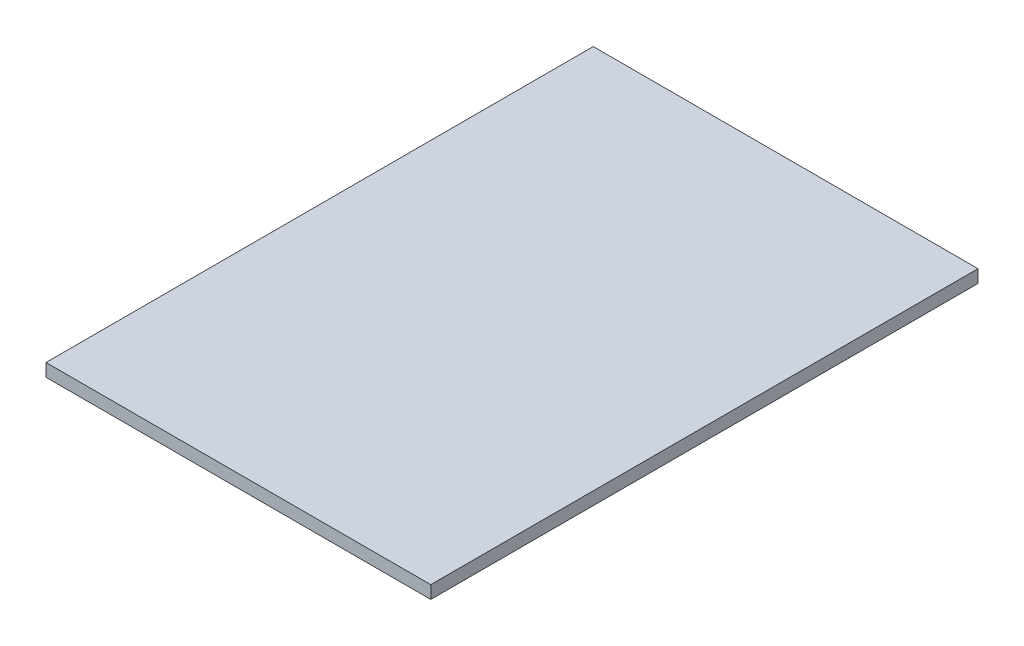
ISO-10303-21;
HEADER;
FILE_DESCRIPTION(('STEP AP214'),'2;1');
FILE_NAME('part.step','',(''),(''),'','','');
FILE_SCHEMA(('AUTOMOTIVE_DESIGN { 1 0 10303 214 1 1 1 1 }'));
ENDSEC;
DATA;
#1=APPLICATION_CONTEXT('core data for automotive mechanical design processes');
#2=APPLICATION_PROTOCOL_DEFINITION('international standard','automotive_design',2000,#1);
#3=PRODUCT_CONTEXT('',#1,'mechanical');
#4=PRODUCT('Part','Part','',(#3));
#5=PRODUCT_RELATED_PRODUCT_CATEGORY('part','',(#4));
#6=PRODUCT_DEFINITION_FORMATION('','',#4);
#7=PRODUCT_DEFINITION_CONTEXT('part definition',#1,'design');
#8=PRODUCT_DEFINITION('design','',#6,#7);
#9=PRODUCT_DEFINITION_SHAPE('','',#8);
#10=(LENGTH_UNIT() NAMED_UNIT(*) SI_UNIT(.MILLI.,.METRE.));
#11=(NAMED_UNIT(*) PLANE_ANGLE_UNIT() SI_UNIT($,.RADIAN.));
#12=(NAMED_UNIT(*) SI_UNIT($,.STERADIAN.) SOLID_ANGLE_UNIT());
#13=UNCERTAINTY_MEASURE_WITH_UNIT(LENGTH_MEASURE(1.E-05),#10,'distance_accuracy_value','');
#14=(GEOMETRIC_REPRESENTATION_CONTEXT(3) GLOBAL_UNCERTAINTY_ASSIGNED_CONTEXT((#13)) GLOBAL_UNIT_ASSIGNED_CONTEXT((#10,
#11,#12)) REPRESENTATION_CONTEXT('',''));
#15=CARTESIAN_POINT('',(0.,0.,0.));
#16=DIRECTION('',(0.,0.,1.));
#17=DIRECTION('',(1.,0.,0.));
#18=AXIS2_PLACEMENT_3D('',#15,#16,#17);
#19=CARTESIAN_POINT('',(0.,4.7625,0.));
#20=DIRECTION('',(1.,0.,0.));
#21=DIRECTION('',(0.,0.,-1.));
#22=AXIS2_PLACEMENT_3D('',#19,#20,#21);
#23=PLANE('',#22);
#24=DIRECTION('',(0.,0.,1.));
#25=VECTOR('',#24,1.);
#26=CARTESIAN_POINT('',(0.,0.,0.));
#27=LINE('',#26,#25);
#28=CARTESIAN_POINT('',(0.,0.,-203.2));
#29=VERTEX_POINT('',#28);
#30=CARTESIAN_POINT('',(0.,0.,0.));
#31=VERTEX_POINT('',#30);
#32=EDGE_CURVE('E98',#29,#31,#27,.T.);
#33=ORIENTED_EDGE('',*,*,#32,.T.);
#34=DIRECTION('',(0.,-1.,0.));
#35=VECTOR('',#34,1.);
#36=CARTESIAN_POINT('',(0.,4.7625,0.));
#37=LINE('',#36,#35);
#38=CARTESIAN_POINT('',(0.,4.7625,0.));
#39=VERTEX_POINT('',#38);
#40=EDGE_CURVE('E11',#39,#31,#37,.T.);
#41=ORIENTED_EDGE('',*,*,#40,.F.);
#42=DIRECTION('',(0.,0.,1.));
#43=VECTOR('',#42,1.);
#44=CARTESIAN_POINT('',(0.,4.7625,0.));
#45=LINE('',#44,#43);
#46=CARTESIAN_POINT('',(0.,4.7625,-203.2));
#47=VERTEX_POINT('',#46);
#48=EDGE_CURVE('E86',#47,#39,#45,.T.);
#49=ORIENTED_EDGE('',*,*,#48,.F.);
#50=DIRECTION('',(0.,-1.,0.));
#51=VECTOR('',#50,1.);
#52=CARTESIAN_POINT('',(0.,4.7625,-203.2));
#53=LINE('',#52,#51);
#54=EDGE_CURVE('E94',#47,#29,#53,.T.);
#55=ORIENTED_EDGE('',*,*,#54,.T.);
#56=EDGE_LOOP('',(#33,#41,#49,#55));
#57=FACE_BOUND('',#56,.T.);
#58=ADVANCED_FACE('F35',(#57),#23,.F.);
#59=CARTESIAN_POINT('',(0.,4.7625,0.));
#60=DIRECTION('',(0.,0.,-1.));
#61=DIRECTION('',(-1.,0.,0.));
#62=AXIS2_PLACEMENT_3D('',#59,#60,#61);
#63=PLANE('',#62);
#64=DIRECTION('',(1.,0.,0.));
#65=VECTOR('',#64,1.);
#66=CARTESIAN_POINT('',(0.,0.,0.));
#67=LINE('',#66,#65);
#68=CARTESIAN_POINT('',(142.875,0.,0.));
#69=VERTEX_POINT('',#68);
#70=EDGE_CURVE('E90',#31,#69,#67,.T.);
#71=ORIENTED_EDGE('',*,*,#70,.T.);
#72=DIRECTION('',(0.,-1.,0.));
#73=VECTOR('',#72,1.);
#74=CARTESIAN_POINT('',(142.875,4.7625,0.));
#75=LINE('',#74,#73);
#76=CARTESIAN_POINT('',(142.875,4.7625,0.));
#77=VERTEX_POINT('',#76);
#78=EDGE_CURVE('E43',#77,#69,#75,.T.);
#79=ORIENTED_EDGE('',*,*,#78,.F.);
#80=DIRECTION('',(1.,0.,0.));
#81=VECTOR('',#80,1.);
#82=CARTESIAN_POINT('',(0.,4.7625,0.));
#83=LINE('',#82,#81);
#84=EDGE_CURVE('E81',#39,#77,#83,.T.);
#85=ORIENTED_EDGE('',*,*,#84,.F.);
#86=ORIENTED_EDGE('',*,*,#40,.T.);
#87=EDGE_LOOP('',(#71,#79,#85,#86));
#88=FACE_BOUND('',#87,.T.);
#89=ADVANCED_FACE('F89',(#88),#63,.F.);
#90=CARTESIAN_POINT('',(142.875,4.7625,0.));
#91=DIRECTION('',(-1.,0.,0.));
#92=DIRECTION('',(0.,0.,1.));
#93=AXIS2_PLACEMENT_3D('',#90,#91,#92);
#94=PLANE('',#93);
#95=DIRECTION('',(0.,0.,-1.));
#96=VECTOR('',#95,1.);
#97=CARTESIAN_POINT('',(142.875,0.,0.));
#98=LINE('',#97,#96);
#99=CARTESIAN_POINT('',(142.875,0.,-203.2));
#100=VERTEX_POINT('',#99);
#101=EDGE_CURVE('E68',#69,#100,#98,.T.);
#102=ORIENTED_EDGE('',*,*,#101,.T.);
#103=DIRECTION('',(0.,-1.,0.));
#104=VECTOR('',#103,1.);
#105=CARTESIAN_POINT('',(142.875,4.7625,-203.2));
#106=LINE('',#105,#104);
#107=CARTESIAN_POINT('',(142.875,4.7625,-203.2));
#108=VERTEX_POINT('',#107);
#109=EDGE_CURVE('E91',#108,#100,#106,.T.);
#110=ORIENTED_EDGE('',*,*,#109,.F.);
#111=DIRECTION('',(0.,0.,-1.));
#112=VECTOR('',#111,1.);
#113=CARTESIAN_POINT('',(142.875,4.7625,0.));
#114=LINE('',#113,#112);
#115=EDGE_CURVE('E84',#77,#108,#114,.T.);
#116=ORIENTED_EDGE('',*,*,#115,.F.);
#117=ORIENTED_EDGE('',*,*,#78,.T.);
#118=EDGE_LOOP('',(#102,#110,#116,#117));
#119=FACE_BOUND('',#118,.T.);
#120=ADVANCED_FACE('F92',(#119),#94,.F.);
#121=CARTESIAN_POINT('',(0.,4.7625,-203.2));
#122=DIRECTION('',(0.,0.,1.));
#123=DIRECTION('',(1.,0.,0.));
#124=AXIS2_PLACEMENT_3D('',#121,#122,#123);
#125=PLANE('',#124);
#126=DIRECTION('',(-1.,0.,0.));
#127=VECTOR('',#126,1.);
#128=CARTESIAN_POINT('',(0.,0.,-203.2));
#129=LINE('',#128,#127);
#130=EDGE_CURVE('E74',#100,#29,#129,.T.);
#131=ORIENTED_EDGE('',*,*,#130,.T.);
#132=ORIENTED_EDGE('',*,*,#54,.F.);
#133=DIRECTION('',(-1.,0.,0.));
#134=VECTOR('',#133,1.);
#135=CARTESIAN_POINT('',(0.,4.7625,-203.2));
#136=LINE('',#135,#134);
#137=EDGE_CURVE('E51',#108,#47,#136,.T.);
#138=ORIENTED_EDGE('',*,*,#137,.F.);
#139=ORIENTED_EDGE('',*,*,#109,.T.);
#140=EDGE_LOOP('',(#131,#132,#138,#139));
#141=FACE_BOUND('',#140,.T.);
#142=ADVANCED_FACE('F105',(#141),#125,.F.);
#143=CARTESIAN_POINT('',(0.,4.7625,0.));
#144=DIRECTION('',(0.,-1.,0.));
#145=DIRECTION('',(0.,0.,-1.));
#146=AXIS2_PLACEMENT_3D('',#143,#144,#145);
#147=PLANE('',#146);
#148=ORIENTED_EDGE('',*,*,#48,.T.);
#149=ORIENTED_EDGE('',*,*,#84,.T.);
#150=ORIENTED_EDGE('',*,*,#115,.T.);
#151=ORIENTED_EDGE('',*,*,#137,.T.);
#152=EDGE_LOOP('',(#148,#149,#150,#151));
#153=FACE_BOUND('',#152,.T.);
#154=ADVANCED_FACE('F82',(#153),#147,.F.);
#155=CARTESIAN_POINT('',(0.,0.,0.));
#156=DIRECTION('',(0.,-1.,0.));
#157=DIRECTION('',(0.,0.,-1.));
#158=AXIS2_PLACEMENT_3D('',#155,#156,#157);
#159=PLANE('',#158);
#160=ORIENTED_EDGE('',*,*,#32,.F.);
#161=ORIENTED_EDGE('',*,*,#130,.F.);
#162=ORIENTED_EDGE('',*,*,#101,.F.);
#163=ORIENTED_EDGE('',*,*,#70,.F.);
#164=EDGE_LOOP('',(#160,#161,#162,#163));
#165=FACE_BOUND('',#164,.T.);
#166=ADVANCED_FACE('F108',(#165),#159,.T.);
#167=CLOSED_SHELL('',(#58,#89,#120,#142,#154,#166));
#168=MANIFOLD_SOLID_BREP('B2',#167);
#169=ADVANCED_BREP_SHAPE_REPRESENTATION('',(#18,#168),#14);
#170=SHAPE_DEFINITION_REPRESENTATION(#9,#169);
ENDSEC;
END-ISO-10303-21;
